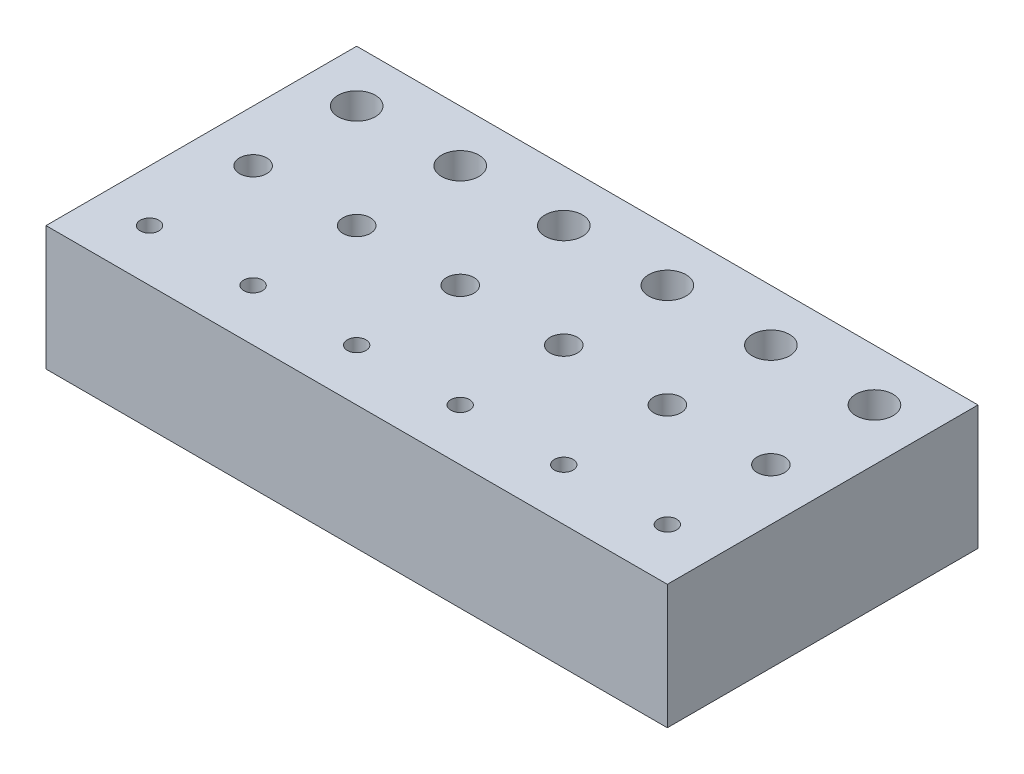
ISO-10303-21;
HEADER;
FILE_DESCRIPTION(('STEP AP214'),'2;1');
FILE_NAME('part.step','',(''),(''),'','','');
FILE_SCHEMA(('AUTOMOTIVE_DESIGN { 1 0 10303 214 1 1 1 1 }'));
ENDSEC;
DATA;
#1=APPLICATION_CONTEXT('core data for automotive mechanical design processes');
#2=APPLICATION_PROTOCOL_DEFINITION('international standard','automotive_design',2000,#1);
#3=PRODUCT_CONTEXT('',#1,'mechanical');
#4=PRODUCT('Part','Part','',(#3));
#5=PRODUCT_RELATED_PRODUCT_CATEGORY('part','',(#4));
#6=PRODUCT_DEFINITION_FORMATION('','',#4);
#7=PRODUCT_DEFINITION_CONTEXT('part definition',#1,'design');
#8=PRODUCT_DEFINITION('design','',#6,#7);
#9=PRODUCT_DEFINITION_SHAPE('','',#8);
#10=(LENGTH_UNIT() NAMED_UNIT(*) SI_UNIT(.MILLI.,.METRE.));
#11=(NAMED_UNIT(*) PLANE_ANGLE_UNIT() SI_UNIT($,.RADIAN.));
#12=(NAMED_UNIT(*) SI_UNIT($,.STERADIAN.) SOLID_ANGLE_UNIT());
#13=UNCERTAINTY_MEASURE_WITH_UNIT(LENGTH_MEASURE(1.E-05),#10,'distance_accuracy_value','');
#14=(GEOMETRIC_REPRESENTATION_CONTEXT(3) GLOBAL_UNCERTAINTY_ASSIGNED_CONTEXT((#13)) GLOBAL_UNIT_ASSIGNED_CONTEXT((#10,
#11,#12)) REPRESENTATION_CONTEXT('',''));
#15=CARTESIAN_POINT('',(0.,0.,0.));
#16=DIRECTION('',(0.,0.,1.));
#17=DIRECTION('',(1.,0.,0.));
#18=AXIS2_PLACEMENT_3D('',#15,#16,#17);
#19=CARTESIAN_POINT('',(62.5,15.,25.));
#20=DIRECTION('',(0.,1.,0.));
#21=DIRECTION('',(0.,0.,1.));
#22=AXIS2_PLACEMENT_3D('',#19,#20,#21);
#23=CYLINDRICAL_SURFACE('',#22,2.25);
#24=CARTESIAN_POINT('',(62.5,-15.,25.));
#25=DIRECTION('',(0.,1.,0.));
#26=DIRECTION('',(0.,0.,1.));
#27=AXIS2_PLACEMENT_3D('',#24,#25,#26);
#28=CIRCLE('',#27,2.25);
#29=CARTESIAN_POINT('',(62.5,-15.,27.25));
#30=VERTEX_POINT('',#29);
#31=EDGE_CURVE('E42',#30,#30,#28,.T.);
#32=ORIENTED_EDGE('',*,*,#31,.F.);
#33=EDGE_LOOP('',(#32));
#34=FACE_BOUND('',#33,.T.);
#35=CARTESIAN_POINT('',(62.5,15.,25.));
#36=DIRECTION('',(0.,1.,0.));
#37=DIRECTION('',(0.,0.,1.));
#38=AXIS2_PLACEMENT_3D('',#35,#36,#37);
#39=CIRCLE('',#38,2.25);
#40=CARTESIAN_POINT('',(62.5,15.,27.25));
#41=VERTEX_POINT('',#40);
#42=EDGE_CURVE('E11',#41,#41,#39,.T.);
#43=ORIENTED_EDGE('',*,*,#42,.T.);
#44=EDGE_LOOP('',(#43));
#45=FACE_BOUND('',#44,.T.);
#46=ADVANCED_FACE('F34',(#34,#45),#23,.F.);
#47=CARTESIAN_POINT('',(37.5,15.,25.));
#48=DIRECTION('',(0.,1.,0.));
#49=DIRECTION('',(0.,0.,1.));
#50=AXIS2_PLACEMENT_3D('',#47,#48,#49);
#51=CYLINDRICAL_SURFACE('',#50,2.25);
#52=CARTESIAN_POINT('',(37.5,-15.,25.));
#53=DIRECTION('',(0.,1.,0.));
#54=DIRECTION('',(0.,0.,1.));
#55=AXIS2_PLACEMENT_3D('',#52,#53,#54);
#56=CIRCLE('',#55,2.25);
#57=CARTESIAN_POINT('',(37.5,-15.,27.25));
#58=VERTEX_POINT('',#57);
#59=EDGE_CURVE('E172',#58,#58,#56,.T.);
#60=ORIENTED_EDGE('',*,*,#59,.F.);
#61=EDGE_LOOP('',(#60));
#62=FACE_BOUND('',#61,.T.);
#63=CARTESIAN_POINT('',(37.5,15.,25.));
#64=DIRECTION('',(0.,1.,0.));
#65=DIRECTION('',(0.,0.,1.));
#66=AXIS2_PLACEMENT_3D('',#63,#64,#65);
#67=CIRCLE('',#66,2.25);
#68=CARTESIAN_POINT('',(37.5,15.,27.25));
#69=VERTEX_POINT('',#68);
#70=EDGE_CURVE('E175',#69,#69,#67,.T.);
#71=ORIENTED_EDGE('',*,*,#70,.T.);
#72=EDGE_LOOP('',(#71));
#73=FACE_BOUND('',#72,.T.);
#74=ADVANCED_FACE('F184',(#62,#73),#51,.F.);
#75=CARTESIAN_POINT('',(12.5,15.,25.));
#76=DIRECTION('',(0.,1.,0.));
#77=DIRECTION('',(0.,0.,1.));
#78=AXIS2_PLACEMENT_3D('',#75,#76,#77);
#79=CYLINDRICAL_SURFACE('',#78,2.25);
#80=CARTESIAN_POINT('',(12.5,-15.,25.));
#81=DIRECTION('',(0.,1.,0.));
#82=DIRECTION('',(0.,0.,1.));
#83=AXIS2_PLACEMENT_3D('',#80,#81,#82);
#84=CIRCLE('',#83,2.25);
#85=CARTESIAN_POINT('',(12.5,-15.,27.25));
#86=VERTEX_POINT('',#85);
#87=EDGE_CURVE('E166',#86,#86,#84,.T.);
#88=ORIENTED_EDGE('',*,*,#87,.F.);
#89=EDGE_LOOP('',(#88));
#90=FACE_BOUND('',#89,.T.);
#91=CARTESIAN_POINT('',(12.5,15.,25.));
#92=DIRECTION('',(0.,1.,0.));
#93=DIRECTION('',(0.,0.,1.));
#94=AXIS2_PLACEMENT_3D('',#91,#92,#93);
#95=CIRCLE('',#94,2.25);
#96=CARTESIAN_POINT('',(12.5,15.,27.25));
#97=VERTEX_POINT('',#96);
#98=EDGE_CURVE('E169',#97,#97,#95,.T.);
#99=ORIENTED_EDGE('',*,*,#98,.T.);
#100=EDGE_LOOP('',(#99));
#101=FACE_BOUND('',#100,.T.);
#102=ADVANCED_FACE('F237',(#90,#101),#79,.F.);
#103=CARTESIAN_POINT('',(-12.5,15.,25.));
#104=DIRECTION('',(0.,1.,0.));
#105=DIRECTION('',(0.,0.,1.));
#106=AXIS2_PLACEMENT_3D('',#103,#104,#105);
#107=CYLINDRICAL_SURFACE('',#106,2.25);
#108=CARTESIAN_POINT('',(-12.5,-15.,25.));
#109=DIRECTION('',(0.,1.,0.));
#110=DIRECTION('',(0.,0.,1.));
#111=AXIS2_PLACEMENT_3D('',#108,#109,#110);
#112=CIRCLE('',#111,2.25);
#113=CARTESIAN_POINT('',(-12.5,-15.,27.25));
#114=VERTEX_POINT('',#113);
#115=EDGE_CURVE('E160',#114,#114,#112,.T.);
#116=ORIENTED_EDGE('',*,*,#115,.F.);
#117=EDGE_LOOP('',(#116));
#118=FACE_BOUND('',#117,.T.);
#119=CARTESIAN_POINT('',(-12.5,15.,25.));
#120=DIRECTION('',(0.,1.,0.));
#121=DIRECTION('',(0.,0.,1.));
#122=AXIS2_PLACEMENT_3D('',#119,#120,#121);
#123=CIRCLE('',#122,2.25);
#124=CARTESIAN_POINT('',(-12.5,15.,27.25));
#125=VERTEX_POINT('',#124);
#126=EDGE_CURVE('E163',#125,#125,#123,.T.);
#127=ORIENTED_EDGE('',*,*,#126,.T.);
#128=EDGE_LOOP('',(#127));
#129=FACE_BOUND('',#128,.T.);
#130=ADVANCED_FACE('F233',(#118,#129),#107,.F.);
#131=CARTESIAN_POINT('',(62.5,15.,0.));
#132=DIRECTION('',(0.,1.,0.));
#133=DIRECTION('',(0.,0.,1.));
#134=AXIS2_PLACEMENT_3D('',#131,#132,#133);
#135=CYLINDRICAL_SURFACE('',#134,3.3);
#136=CARTESIAN_POINT('',(62.5,-15.,0.));
#137=DIRECTION('',(0.,1.,0.));
#138=DIRECTION('',(0.,0.,1.));
#139=AXIS2_PLACEMENT_3D('',#136,#137,#138);
#140=CIRCLE('',#139,3.3);
#141=CARTESIAN_POINT('',(62.5,-15.,3.3));
#142=VERTEX_POINT('',#141);
#143=EDGE_CURVE('E154',#142,#142,#140,.T.);
#144=ORIENTED_EDGE('',*,*,#143,.F.);
#145=EDGE_LOOP('',(#144));
#146=FACE_BOUND('',#145,.T.);
#147=CARTESIAN_POINT('',(62.5,15.,0.));
#148=DIRECTION('',(0.,1.,0.));
#149=DIRECTION('',(0.,0.,1.));
#150=AXIS2_PLACEMENT_3D('',#147,#148,#149);
#151=CIRCLE('',#150,3.3);
#152=CARTESIAN_POINT('',(62.5,15.,3.3));
#153=VERTEX_POINT('',#152);
#154=EDGE_CURVE('E157',#153,#153,#151,.T.);
#155=ORIENTED_EDGE('',*,*,#154,.T.);
#156=EDGE_LOOP('',(#155));
#157=FACE_BOUND('',#156,.T.);
#158=ADVANCED_FACE('F229',(#146,#157),#135,.F.);
#159=CARTESIAN_POINT('',(37.5,15.,0.));
#160=DIRECTION('',(0.,1.,0.));
#161=DIRECTION('',(0.,0.,1.));
#162=AXIS2_PLACEMENT_3D('',#159,#160,#161);
#163=CYLINDRICAL_SURFACE('',#162,3.3);
#164=CARTESIAN_POINT('',(37.5,-15.,0.));
#165=DIRECTION('',(0.,1.,0.));
#166=DIRECTION('',(0.,0.,1.));
#167=AXIS2_PLACEMENT_3D('',#164,#165,#166);
#168=CIRCLE('',#167,3.3);
#169=CARTESIAN_POINT('',(37.5,-15.,3.3));
#170=VERTEX_POINT('',#169);
#171=EDGE_CURVE('E148',#170,#170,#168,.T.);
#172=ORIENTED_EDGE('',*,*,#171,.F.);
#173=EDGE_LOOP('',(#172));
#174=FACE_BOUND('',#173,.T.);
#175=CARTESIAN_POINT('',(37.5,15.,0.));
#176=DIRECTION('',(0.,1.,0.));
#177=DIRECTION('',(0.,0.,1.));
#178=AXIS2_PLACEMENT_3D('',#175,#176,#177);
#179=CIRCLE('',#178,3.3);
#180=CARTESIAN_POINT('',(37.5,15.,3.3));
#181=VERTEX_POINT('',#180);
#182=EDGE_CURVE('E151',#181,#181,#179,.T.);
#183=ORIENTED_EDGE('',*,*,#182,.T.);
#184=EDGE_LOOP('',(#183));
#185=FACE_BOUND('',#184,.T.);
#186=ADVANCED_FACE('F225',(#174,#185),#163,.F.);
#187=CARTESIAN_POINT('',(12.5,15.,0.));
#188=DIRECTION('',(0.,1.,0.));
#189=DIRECTION('',(0.,0.,1.));
#190=AXIS2_PLACEMENT_3D('',#187,#188,#189);
#191=CYLINDRICAL_SURFACE('',#190,3.3);
#192=CARTESIAN_POINT('',(12.5,-15.,0.));
#193=DIRECTION('',(0.,1.,0.));
#194=DIRECTION('',(0.,0.,1.));
#195=AXIS2_PLACEMENT_3D('',#192,#193,#194);
#196=CIRCLE('',#195,3.3);
#197=CARTESIAN_POINT('',(12.5,-15.,3.3));
#198=VERTEX_POINT('',#197);
#199=EDGE_CURVE('E142',#198,#198,#196,.T.);
#200=ORIENTED_EDGE('',*,*,#199,.F.);
#201=EDGE_LOOP('',(#200));
#202=FACE_BOUND('',#201,.T.);
#203=CARTESIAN_POINT('',(12.5,15.,0.));
#204=DIRECTION('',(0.,1.,0.));
#205=DIRECTION('',(0.,0.,1.));
#206=AXIS2_PLACEMENT_3D('',#203,#204,#205);
#207=CIRCLE('',#206,3.3);
#208=CARTESIAN_POINT('',(12.5,15.,3.3));
#209=VERTEX_POINT('',#208);
#210=EDGE_CURVE('E145',#209,#209,#207,.T.);
#211=ORIENTED_EDGE('',*,*,#210,.T.);
#212=EDGE_LOOP('',(#211));
#213=FACE_BOUND('',#212,.T.);
#214=ADVANCED_FACE('F221',(#202,#213),#191,.F.);
#215=CARTESIAN_POINT('',(-12.5,15.,0.));
#216=DIRECTION('',(0.,1.,0.));
#217=DIRECTION('',(0.,0.,1.));
#218=AXIS2_PLACEMENT_3D('',#215,#216,#217);
#219=CYLINDRICAL_SURFACE('',#218,3.3);
#220=CARTESIAN_POINT('',(-12.5,-15.,0.));
#221=DIRECTION('',(0.,1.,0.));
#222=DIRECTION('',(0.,0.,1.));
#223=AXIS2_PLACEMENT_3D('',#220,#221,#222);
#224=CIRCLE('',#223,3.3);
#225=CARTESIAN_POINT('',(-12.5,-15.,3.3));
#226=VERTEX_POINT('',#225);
#227=EDGE_CURVE('E136',#226,#226,#224,.T.);
#228=ORIENTED_EDGE('',*,*,#227,.F.);
#229=EDGE_LOOP('',(#228));
#230=FACE_BOUND('',#229,.T.);
#231=CARTESIAN_POINT('',(-12.5,15.,0.));
#232=DIRECTION('',(0.,1.,0.));
#233=DIRECTION('',(0.,0.,1.));
#234=AXIS2_PLACEMENT_3D('',#231,#232,#233);
#235=CIRCLE('',#234,3.3);
#236=CARTESIAN_POINT('',(-12.5,15.,3.3));
#237=VERTEX_POINT('',#236);
#238=EDGE_CURVE('E139',#237,#237,#235,.T.);
#239=ORIENTED_EDGE('',*,*,#238,.T.);
#240=EDGE_LOOP('',(#239));
#241=FACE_BOUND('',#240,.T.);
#242=ADVANCED_FACE('F217',(#230,#241),#219,.F.);
#243=CARTESIAN_POINT('',(62.5,15.,-25.));
#244=DIRECTION('',(0.,1.,0.));
#245=DIRECTION('',(0.,0.,1.));
#246=AXIS2_PLACEMENT_3D('',#243,#244,#245);
#247=CYLINDRICAL_SURFACE('',#246,4.5);
#248=CARTESIAN_POINT('',(62.5,-15.,-25.));
#249=DIRECTION('',(0.,1.,0.));
#250=DIRECTION('',(0.,0.,1.));
#251=AXIS2_PLACEMENT_3D('',#248,#249,#250);
#252=CIRCLE('',#251,4.5);
#253=CARTESIAN_POINT('',(62.5,-15.,-20.5));
#254=VERTEX_POINT('',#253);
#255=EDGE_CURVE('E130',#254,#254,#252,.T.);
#256=ORIENTED_EDGE('',*,*,#255,.F.);
#257=EDGE_LOOP('',(#256));
#258=FACE_BOUND('',#257,.T.);
#259=CARTESIAN_POINT('',(62.5,15.,-25.));
#260=DIRECTION('',(0.,1.,0.));
#261=DIRECTION('',(0.,0.,1.));
#262=AXIS2_PLACEMENT_3D('',#259,#260,#261);
#263=CIRCLE('',#262,4.5);
#264=CARTESIAN_POINT('',(62.5,15.,-20.5));
#265=VERTEX_POINT('',#264);
#266=EDGE_CURVE('E133',#265,#265,#263,.T.);
#267=ORIENTED_EDGE('',*,*,#266,.T.);
#268=EDGE_LOOP('',(#267));
#269=FACE_BOUND('',#268,.T.);
#270=ADVANCED_FACE('F213',(#258,#269),#247,.F.);
#271=CARTESIAN_POINT('',(37.5,15.,-25.));
#272=DIRECTION('',(0.,1.,0.));
#273=DIRECTION('',(0.,0.,1.));
#274=AXIS2_PLACEMENT_3D('',#271,#272,#273);
#275=CYLINDRICAL_SURFACE('',#274,4.5);
#276=CARTESIAN_POINT('',(37.5,-15.,-25.));
#277=DIRECTION('',(0.,1.,0.));
#278=DIRECTION('',(0.,0.,1.));
#279=AXIS2_PLACEMENT_3D('',#276,#277,#278);
#280=CIRCLE('',#279,4.5);
#281=CARTESIAN_POINT('',(37.5,-15.,-20.5));
#282=VERTEX_POINT('',#281);
#283=EDGE_CURVE('E124',#282,#282,#280,.T.);
#284=ORIENTED_EDGE('',*,*,#283,.F.);
#285=EDGE_LOOP('',(#284));
#286=FACE_BOUND('',#285,.T.);
#287=CARTESIAN_POINT('',(37.5,15.,-25.));
#288=DIRECTION('',(0.,1.,0.));
#289=DIRECTION('',(0.,0.,1.));
#290=AXIS2_PLACEMENT_3D('',#287,#288,#289);
#291=CIRCLE('',#290,4.5);
#292=CARTESIAN_POINT('',(37.5,15.,-20.5));
#293=VERTEX_POINT('',#292);
#294=EDGE_CURVE('E127',#293,#293,#291,.T.);
#295=ORIENTED_EDGE('',*,*,#294,.T.);
#296=EDGE_LOOP('',(#295));
#297=FACE_BOUND('',#296,.T.);
#298=ADVANCED_FACE('F209',(#286,#297),#275,.F.);
#299=CARTESIAN_POINT('',(12.5,15.,-25.));
#300=DIRECTION('',(0.,1.,0.));
#301=DIRECTION('',(0.,0.,1.));
#302=AXIS2_PLACEMENT_3D('',#299,#300,#301);
#303=CYLINDRICAL_SURFACE('',#302,4.5);
#304=CARTESIAN_POINT('',(12.5,-15.,-25.));
#305=DIRECTION('',(0.,1.,0.));
#306=DIRECTION('',(0.,0.,1.));
#307=AXIS2_PLACEMENT_3D('',#304,#305,#306);
#308=CIRCLE('',#307,4.5);
#309=CARTESIAN_POINT('',(12.5,-15.,-20.5));
#310=VERTEX_POINT('',#309);
#311=EDGE_CURVE('E118',#310,#310,#308,.T.);
#312=ORIENTED_EDGE('',*,*,#311,.F.);
#313=EDGE_LOOP('',(#312));
#314=FACE_BOUND('',#313,.T.);
#315=CARTESIAN_POINT('',(12.5,15.,-25.));
#316=DIRECTION('',(0.,1.,0.));
#317=DIRECTION('',(0.,0.,1.));
#318=AXIS2_PLACEMENT_3D('',#315,#316,#317);
#319=CIRCLE('',#318,4.5);
#320=CARTESIAN_POINT('',(12.5,15.,-20.5));
#321=VERTEX_POINT('',#320);
#322=EDGE_CURVE('E121',#321,#321,#319,.T.);
#323=ORIENTED_EDGE('',*,*,#322,.T.);
#324=EDGE_LOOP('',(#323));
#325=FACE_BOUND('',#324,.T.);
#326=ADVANCED_FACE('F205',(#314,#325),#303,.F.);
#327=CARTESIAN_POINT('',(-12.5,15.,-25.));
#328=DIRECTION('',(0.,1.,0.));
#329=DIRECTION('',(0.,0.,1.));
#330=AXIS2_PLACEMENT_3D('',#327,#328,#329);
#331=CYLINDRICAL_SURFACE('',#330,4.5);
#332=CARTESIAN_POINT('',(-12.5,-15.,-25.));
#333=DIRECTION('',(0.,1.,0.));
#334=DIRECTION('',(0.,0.,1.));
#335=AXIS2_PLACEMENT_3D('',#332,#333,#334);
#336=CIRCLE('',#335,4.5);
#337=CARTESIAN_POINT('',(-12.5,-15.,-20.5));
#338=VERTEX_POINT('',#337);
#339=EDGE_CURVE('E112',#338,#338,#336,.T.);
#340=ORIENTED_EDGE('',*,*,#339,.F.);
#341=EDGE_LOOP('',(#340));
#342=FACE_BOUND('',#341,.T.);
#343=CARTESIAN_POINT('',(-12.5,15.,-25.));
#344=DIRECTION('',(0.,1.,0.));
#345=DIRECTION('',(0.,0.,1.));
#346=AXIS2_PLACEMENT_3D('',#343,#344,#345);
#347=CIRCLE('',#346,4.5);
#348=CARTESIAN_POINT('',(-12.5,15.,-20.5));
#349=VERTEX_POINT('',#348);
#350=EDGE_CURVE('E115',#349,#349,#347,.T.);
#351=ORIENTED_EDGE('',*,*,#350,.T.);
#352=EDGE_LOOP('',(#351));
#353=FACE_BOUND('',#352,.T.);
#354=ADVANCED_FACE('F196',(#342,#353),#331,.F.);
#355=CARTESIAN_POINT('',(75.,15.,37.5));
#356=DIRECTION('',(-1.,0.,0.));
#357=DIRECTION('',(0.,0.,1.));
#358=AXIS2_PLACEMENT_3D('',#355,#356,#357);
#359=PLANE('',#358);
#360=DIRECTION('',(0.,1.,0.));
#361=VECTOR('',#360,1.);
#362=CARTESIAN_POINT('',(75.,15.,-37.5));
#363=LINE('',#362,#361);
#364=CARTESIAN_POINT('',(75.,-15.,-37.5));
#365=VERTEX_POINT('',#364);
#366=CARTESIAN_POINT('',(75.,15.,-37.5));
#367=VERTEX_POINT('',#366);
#368=EDGE_CURVE('E102',#365,#367,#363,.T.);
#369=ORIENTED_EDGE('',*,*,#368,.T.);
#370=DIRECTION('',(0.,0.,-1.));
#371=VECTOR('',#370,1.);
#372=CARTESIAN_POINT('',(75.,15.,37.5));
#373=LINE('',#372,#371);
#374=CARTESIAN_POINT('',(75.,15.,37.5));
#375=VERTEX_POINT('',#374);
#376=EDGE_CURVE('E93',#375,#367,#373,.T.);
#377=ORIENTED_EDGE('',*,*,#376,.F.);
#378=DIRECTION('',(0.,1.,0.));
#379=VECTOR('',#378,1.);
#380=CARTESIAN_POINT('',(75.,15.,37.5));
#381=LINE('',#380,#379);
#382=CARTESIAN_POINT('',(75.,-15.,37.5));
#383=VERTEX_POINT('',#382);
#384=EDGE_CURVE('E86',#383,#375,#381,.T.);
#385=ORIENTED_EDGE('',*,*,#384,.F.);
#386=DIRECTION('',(0.,0.,-1.));
#387=VECTOR('',#386,1.);
#388=CARTESIAN_POINT('',(75.,-15.,37.5));
#389=LINE('',#388,#387);
#390=EDGE_CURVE('E98',#383,#365,#389,.T.);
#391=ORIENTED_EDGE('',*,*,#390,.T.);
#392=EDGE_LOOP('',(#369,#377,#385,#391));
#393=FACE_BOUND('',#392,.T.);
#394=ADVANCED_FACE('F188',(#393),#359,.F.);
#395=CARTESIAN_POINT('',(-75.,15.,37.5));
#396=DIRECTION('',(0.,-1.,0.));
#397=DIRECTION('',(0.,0.,-1.));
#398=AXIS2_PLACEMENT_3D('',#395,#396,#397);
#399=PLANE('',#398);
#400=CARTESIAN_POINT('',(-37.5,15.,25.));
#401=DIRECTION('',(0.,1.,0.));
#402=DIRECTION('',(0.,0.,1.));
#403=AXIS2_PLACEMENT_3D('',#400,#401,#402);
#404=CIRCLE('',#403,2.25);
#405=CARTESIAN_POINT('',(-37.5,15.,27.25));
#406=VERTEX_POINT('',#405);
#407=EDGE_CURVE('E292',#406,#406,#404,.T.);
#408=ORIENTED_EDGE('',*,*,#407,.F.);
#409=EDGE_LOOP('',(#408));
#410=FACE_BOUND('',#409,.T.);
#411=CARTESIAN_POINT('',(-62.5,15.,25.));
#412=DIRECTION('',(0.,1.,0.));
#413=DIRECTION('',(0.,0.,1.));
#414=AXIS2_PLACEMENT_3D('',#411,#412,#413);
#415=CIRCLE('',#414,2.25);
#416=CARTESIAN_POINT('',(-62.5,15.,27.25));
#417=VERTEX_POINT('',#416);
#418=EDGE_CURVE('E293',#417,#417,#415,.T.);
#419=ORIENTED_EDGE('',*,*,#418,.F.);
#420=EDGE_LOOP('',(#419));
#421=FACE_BOUND('',#420,.T.);
#422=CARTESIAN_POINT('',(-37.5,15.,0.));
#423=DIRECTION('',(0.,1.,0.));
#424=DIRECTION('',(0.,0.,1.));
#425=AXIS2_PLACEMENT_3D('',#422,#423,#424);
#426=CIRCLE('',#425,3.3);
#427=CARTESIAN_POINT('',(-37.5,15.,3.3));
#428=VERTEX_POINT('',#427);
#429=EDGE_CURVE('E305',#428,#428,#426,.T.);
#430=ORIENTED_EDGE('',*,*,#429,.F.);
#431=EDGE_LOOP('',(#430));
#432=FACE_BOUND('',#431,.T.);
#433=CARTESIAN_POINT('',(-62.5,15.,0.));
#434=DIRECTION('',(0.,1.,0.));
#435=DIRECTION('',(0.,0.,1.));
#436=AXIS2_PLACEMENT_3D('',#433,#434,#435);
#437=CIRCLE('',#436,3.3);
#438=CARTESIAN_POINT('',(-62.5,15.,3.3));
#439=VERTEX_POINT('',#438);
#440=EDGE_CURVE('E308',#439,#439,#437,.T.);
#441=ORIENTED_EDGE('',*,*,#440,.F.);
#442=EDGE_LOOP('',(#441));
#443=FACE_BOUND('',#442,.T.);
#444=CARTESIAN_POINT('',(-37.5,15.,-25.));
#445=DIRECTION('',(0.,1.,0.));
#446=DIRECTION('',(0.,0.,1.));
#447=AXIS2_PLACEMENT_3D('',#444,#445,#446);
#448=CIRCLE('',#447,4.5);
#449=CARTESIAN_POINT('',(-37.5,15.,-20.5));
#450=VERTEX_POINT('',#449);
#451=EDGE_CURVE('E317',#450,#450,#448,.T.);
#452=ORIENTED_EDGE('',*,*,#451,.F.);
#453=EDGE_LOOP('',(#452));
#454=FACE_BOUND('',#453,.T.);
#455=CARTESIAN_POINT('',(-62.5,15.,-25.));
#456=DIRECTION('',(0.,1.,0.));
#457=DIRECTION('',(0.,0.,1.));
#458=AXIS2_PLACEMENT_3D('',#455,#456,#457);
#459=CIRCLE('',#458,4.5);
#460=CARTESIAN_POINT('',(-62.5,15.,-20.5));
#461=VERTEX_POINT('',#460);
#462=EDGE_CURVE('E320',#461,#461,#459,.T.);
#463=ORIENTED_EDGE('',*,*,#462,.F.);
#464=EDGE_LOOP('',(#463));
#465=FACE_BOUND('',#464,.T.);
#466=DIRECTION('',(-1.,0.,0.));
#467=VECTOR('',#466,1.);
#468=CARTESIAN_POINT('',(-75.,15.,-37.5));
#469=LINE('',#468,#467);
#470=CARTESIAN_POINT('',(-75.,15.,-37.5));
#471=VERTEX_POINT('',#470);
#472=EDGE_CURVE('E92',#367,#471,#469,.T.);
#473=ORIENTED_EDGE('',*,*,#472,.T.);
#474=DIRECTION('',(0.,0.,-1.));
#475=VECTOR('',#474,1.);
#476=CARTESIAN_POINT('',(-75.,15.,37.5));
#477=LINE('',#476,#475);
#478=CARTESIAN_POINT('',(-75.,15.,37.5));
#479=VERTEX_POINT('',#478);
#480=EDGE_CURVE('E89',#479,#471,#477,.T.);
#481=ORIENTED_EDGE('',*,*,#480,.F.);
#482=DIRECTION('',(-1.,0.,0.));
#483=VECTOR('',#482,1.);
#484=CARTESIAN_POINT('',(-75.,15.,37.5));
#485=LINE('',#484,#483);
#486=EDGE_CURVE('E81',#375,#479,#485,.T.);
#487=ORIENTED_EDGE('',*,*,#486,.F.);
#488=ORIENTED_EDGE('',*,*,#376,.T.);
#489=EDGE_LOOP('',(#473,#481,#487,#488));
#490=FACE_BOUND('',#489,.T.);
#491=ORIENTED_EDGE('',*,*,#350,.F.);
#492=EDGE_LOOP('',(#491));
#493=FACE_BOUND('',#492,.T.);
#494=ORIENTED_EDGE('',*,*,#322,.F.);
#495=EDGE_LOOP('',(#494));
#496=FACE_BOUND('',#495,.T.);
#497=ORIENTED_EDGE('',*,*,#294,.F.);
#498=EDGE_LOOP('',(#497));
#499=FACE_BOUND('',#498,.T.);
#500=ORIENTED_EDGE('',*,*,#266,.F.);
#501=EDGE_LOOP('',(#500));
#502=FACE_BOUND('',#501,.T.);
#503=ORIENTED_EDGE('',*,*,#238,.F.);
#504=EDGE_LOOP('',(#503));
#505=FACE_BOUND('',#504,.T.);
#506=ORIENTED_EDGE('',*,*,#210,.F.);
#507=EDGE_LOOP('',(#506));
#508=FACE_BOUND('',#507,.T.);
#509=ORIENTED_EDGE('',*,*,#182,.F.);
#510=EDGE_LOOP('',(#509));
#511=FACE_BOUND('',#510,.T.);
#512=ORIENTED_EDGE('',*,*,#154,.F.);
#513=EDGE_LOOP('',(#512));
#514=FACE_BOUND('',#513,.T.);
#515=ORIENTED_EDGE('',*,*,#126,.F.);
#516=EDGE_LOOP('',(#515));
#517=FACE_BOUND('',#516,.T.);
#518=ORIENTED_EDGE('',*,*,#98,.F.);
#519=EDGE_LOOP('',(#518));
#520=FACE_BOUND('',#519,.T.);
#521=ORIENTED_EDGE('',*,*,#70,.F.);
#522=EDGE_LOOP('',(#521));
#523=FACE_BOUND('',#522,.T.);
#524=ORIENTED_EDGE('',*,*,#42,.F.);
#525=EDGE_LOOP('',(#524));
#526=FACE_BOUND('',#525,.T.);
#527=ADVANCED_FACE('F90',(#410,#421,#432,#443,#454,#465,#490,#493,#496,#499,#502,#505,#508,#511,
#514,#517,#520,#523,#526),#399,.F.);
#528=CARTESIAN_POINT('',(-75.,15.,37.5));
#529=DIRECTION('',(1.,0.,0.));
#530=DIRECTION('',(0.,0.,-1.));
#531=AXIS2_PLACEMENT_3D('',#528,#529,#530);
#532=PLANE('',#531);
#533=DIRECTION('',(0.,-1.,0.));
#534=VECTOR('',#533,1.);
#535=CARTESIAN_POINT('',(-75.,15.,-37.5));
#536=LINE('',#535,#534);
#537=CARTESIAN_POINT('',(-75.,-15.,-37.5));
#538=VERTEX_POINT('',#537);
#539=EDGE_CURVE('E67',#471,#538,#536,.T.);
#540=ORIENTED_EDGE('',*,*,#539,.T.);
#541=DIRECTION('',(0.,0.,-1.));
#542=VECTOR('',#541,1.);
#543=CARTESIAN_POINT('',(-75.,-15.,37.5));
#544=LINE('',#543,#542);
#545=CARTESIAN_POINT('',(-75.,-15.,37.5));
#546=VERTEX_POINT('',#545);
#547=EDGE_CURVE('E94',#546,#538,#544,.T.);
#548=ORIENTED_EDGE('',*,*,#547,.F.);
#549=DIRECTION('',(0.,-1.,0.));
#550=VECTOR('',#549,1.);
#551=CARTESIAN_POINT('',(-75.,15.,37.5));
#552=LINE('',#551,#550);
#553=EDGE_CURVE('E84',#479,#546,#552,.T.);
#554=ORIENTED_EDGE('',*,*,#553,.F.);
#555=ORIENTED_EDGE('',*,*,#480,.T.);
#556=EDGE_LOOP('',(#540,#548,#554,#555));
#557=FACE_BOUND('',#556,.T.);
#558=ADVANCED_FACE('F96',(#557),#532,.F.);
#559=CARTESIAN_POINT('',(-75.,-15.,37.5));
#560=DIRECTION('',(0.,1.,0.));
#561=DIRECTION('',(0.,0.,1.));
#562=AXIS2_PLACEMENT_3D('',#559,#560,#561);
#563=PLANE('',#562);
#564=CARTESIAN_POINT('',(-37.5,-15.,25.));
#565=DIRECTION('',(0.,1.,0.));
#566=DIRECTION('',(0.,0.,1.));
#567=AXIS2_PLACEMENT_3D('',#564,#565,#566);
#568=CIRCLE('',#567,2.25);
#569=CARTESIAN_POINT('',(-37.5,-15.,27.25));
#570=VERTEX_POINT('',#569);
#571=EDGE_CURVE('E290',#570,#570,#568,.T.);
#572=ORIENTED_EDGE('',*,*,#571,.T.);
#573=EDGE_LOOP('',(#572));
#574=FACE_BOUND('',#573,.T.);
#575=CARTESIAN_POINT('',(-62.5,-15.,25.));
#576=DIRECTION('',(0.,1.,0.));
#577=DIRECTION('',(0.,0.,1.));
#578=AXIS2_PLACEMENT_3D('',#575,#576,#577);
#579=CIRCLE('',#578,2.25);
#580=CARTESIAN_POINT('',(-62.5,-15.,27.25));
#581=VERTEX_POINT('',#580);
#582=EDGE_CURVE('E296',#581,#581,#579,.T.);
#583=ORIENTED_EDGE('',*,*,#582,.T.);
#584=EDGE_LOOP('',(#583));
#585=FACE_BOUND('',#584,.T.);
#586=CARTESIAN_POINT('',(-37.5,-15.,0.));
#587=DIRECTION('',(0.,1.,0.));
#588=DIRECTION('',(0.,0.,1.));
#589=AXIS2_PLACEMENT_3D('',#586,#587,#588);
#590=CIRCLE('',#589,3.3);
#591=CARTESIAN_POINT('',(-37.5,-15.,3.3));
#592=VERTEX_POINT('',#591);
#593=EDGE_CURVE('E302',#592,#592,#590,.T.);
#594=ORIENTED_EDGE('',*,*,#593,.T.);
#595=EDGE_LOOP('',(#594));
#596=FACE_BOUND('',#595,.T.);
#597=CARTESIAN_POINT('',(-62.5,-15.,0.));
#598=DIRECTION('',(0.,1.,0.));
#599=DIRECTION('',(0.,0.,1.));
#600=AXIS2_PLACEMENT_3D('',#597,#598,#599);
#601=CIRCLE('',#600,3.3);
#602=CARTESIAN_POINT('',(-62.5,-15.,3.3));
#603=VERTEX_POINT('',#602);
#604=EDGE_CURVE('E311',#603,#603,#601,.T.);
#605=ORIENTED_EDGE('',*,*,#604,.T.);
#606=EDGE_LOOP('',(#605));
#607=FACE_BOUND('',#606,.T.);
#608=CARTESIAN_POINT('',(-37.5,-15.,-25.));
#609=DIRECTION('',(0.,1.,0.));
#610=DIRECTION('',(0.,0.,1.));
#611=AXIS2_PLACEMENT_3D('',#608,#609,#610);
#612=CIRCLE('',#611,4.5);
#613=CARTESIAN_POINT('',(-37.5,-15.,-20.5));
#614=VERTEX_POINT('',#613);
#615=EDGE_CURVE('E314',#614,#614,#612,.T.);
#616=ORIENTED_EDGE('',*,*,#615,.T.);
#617=EDGE_LOOP('',(#616));
#618=FACE_BOUND('',#617,.T.);
#619=CARTESIAN_POINT('',(-62.5,-15.,-25.));
#620=DIRECTION('',(0.,1.,0.));
#621=DIRECTION('',(0.,0.,1.));
#622=AXIS2_PLACEMENT_3D('',#619,#620,#621);
#623=CIRCLE('',#622,4.5);
#624=CARTESIAN_POINT('',(-62.5,-15.,-20.5));
#625=VERTEX_POINT('',#624);
#626=EDGE_CURVE('E105',#625,#625,#623,.T.);
#627=ORIENTED_EDGE('',*,*,#626,.T.);
#628=EDGE_LOOP('',(#627));
#629=FACE_BOUND('',#628,.T.);
#630=DIRECTION('',(1.,0.,0.));
#631=VECTOR('',#630,1.);
#632=CARTESIAN_POINT('',(-75.,-15.,-37.5));
#633=LINE('',#632,#631);
#634=EDGE_CURVE('E73',#538,#365,#633,.T.);
#635=ORIENTED_EDGE('',*,*,#634,.T.);
#636=ORIENTED_EDGE('',*,*,#390,.F.);
#637=DIRECTION('',(1.,0.,0.));
#638=VECTOR('',#637,1.);
#639=CARTESIAN_POINT('',(-75.,-15.,37.5));
#640=LINE('',#639,#638);
#641=EDGE_CURVE('E50',#546,#383,#640,.T.);
#642=ORIENTED_EDGE('',*,*,#641,.F.);
#643=ORIENTED_EDGE('',*,*,#547,.T.);
#644=EDGE_LOOP('',(#635,#636,#642,#643));
#645=FACE_BOUND('',#644,.T.);
#646=ORIENTED_EDGE('',*,*,#339,.T.);
#647=EDGE_LOOP('',(#646));
#648=FACE_BOUND('',#647,.T.);
#649=ORIENTED_EDGE('',*,*,#311,.T.);
#650=EDGE_LOOP('',(#649));
#651=FACE_BOUND('',#650,.T.);
#652=ORIENTED_EDGE('',*,*,#283,.T.);
#653=EDGE_LOOP('',(#652));
#654=FACE_BOUND('',#653,.T.);
#655=ORIENTED_EDGE('',*,*,#255,.T.);
#656=EDGE_LOOP('',(#655));
#657=FACE_BOUND('',#656,.T.);
#658=ORIENTED_EDGE('',*,*,#227,.T.);
#659=EDGE_LOOP('',(#658));
#660=FACE_BOUND('',#659,.T.);
#661=ORIENTED_EDGE('',*,*,#199,.T.);
#662=EDGE_LOOP('',(#661));
#663=FACE_BOUND('',#662,.T.);
#664=ORIENTED_EDGE('',*,*,#171,.T.);
#665=EDGE_LOOP('',(#664));
#666=FACE_BOUND('',#665,.T.);
#667=ORIENTED_EDGE('',*,*,#143,.T.);
#668=EDGE_LOOP('',(#667));
#669=FACE_BOUND('',#668,.T.);
#670=ORIENTED_EDGE('',*,*,#115,.T.);
#671=EDGE_LOOP('',(#670));
#672=FACE_BOUND('',#671,.T.);
#673=ORIENTED_EDGE('',*,*,#87,.T.);
#674=EDGE_LOOP('',(#673));
#675=FACE_BOUND('',#674,.T.);
#676=ORIENTED_EDGE('',*,*,#59,.T.);
#677=EDGE_LOOP('',(#676));
#678=FACE_BOUND('',#677,.T.);
#679=ORIENTED_EDGE('',*,*,#31,.T.);
#680=EDGE_LOOP('',(#679));
#681=FACE_BOUND('',#680,.T.);
#682=ADVANCED_FACE('F180',(#574,#585,#596,#607,#618,#629,#645,#648,#651,#654,#657,#660,#663,
#666,#669,#672,#675,#678,#681),#563,.F.);
#683=CARTESIAN_POINT('',(0.,0.,37.5));
#684=DIRECTION('',(0.,0.,1.));
#685=DIRECTION('',(1.,0.,0.));
#686=AXIS2_PLACEMENT_3D('',#683,#684,#685);
#687=PLANE('',#686);
#688=ORIENTED_EDGE('',*,*,#384,.T.);
#689=ORIENTED_EDGE('',*,*,#486,.T.);
#690=ORIENTED_EDGE('',*,*,#553,.T.);
#691=ORIENTED_EDGE('',*,*,#641,.T.);
#692=EDGE_LOOP('',(#688,#689,#690,#691));
#693=FACE_BOUND('',#692,.T.);
#694=ADVANCED_FACE('F82',(#693),#687,.T.);
#695=CARTESIAN_POINT('',(0.,0.,-37.5));
#696=DIRECTION('',(0.,0.,1.));
#697=DIRECTION('',(1.,0.,0.));
#698=AXIS2_PLACEMENT_3D('',#695,#696,#697);
#699=PLANE('',#698);
#700=ORIENTED_EDGE('',*,*,#368,.F.);
#701=ORIENTED_EDGE('',*,*,#634,.F.);
#702=ORIENTED_EDGE('',*,*,#539,.F.);
#703=ORIENTED_EDGE('',*,*,#472,.F.);
#704=EDGE_LOOP('',(#700,#701,#702,#703));
#705=FACE_BOUND('',#704,.T.);
#706=ADVANCED_FACE('F255',(#705),#699,.F.);
#707=CARTESIAN_POINT('',(-62.5,15.,-25.));
#708=DIRECTION('',(0.,1.,0.));
#709=DIRECTION('',(0.,0.,1.));
#710=AXIS2_PLACEMENT_3D('',#707,#708,#709);
#711=CYLINDRICAL_SURFACE('',#710,4.5);
#712=ORIENTED_EDGE('',*,*,#626,.F.);
#713=EDGE_LOOP('',(#712));
#714=FACE_BOUND('',#713,.T.);
#715=ORIENTED_EDGE('',*,*,#462,.T.);
#716=EDGE_LOOP('',(#715));
#717=FACE_BOUND('',#716,.T.);
#718=ADVANCED_FACE('F261',(#714,#717),#711,.F.);
#719=CARTESIAN_POINT('',(-37.5,15.,-25.));
#720=DIRECTION('',(0.,1.,0.));
#721=DIRECTION('',(0.,0.,1.));
#722=AXIS2_PLACEMENT_3D('',#719,#720,#721);
#723=CYLINDRICAL_SURFACE('',#722,4.5);
#724=ORIENTED_EDGE('',*,*,#615,.F.);
#725=EDGE_LOOP('',(#724));
#726=FACE_BOUND('',#725,.T.);
#727=ORIENTED_EDGE('',*,*,#451,.T.);
#728=EDGE_LOOP('',(#727));
#729=FACE_BOUND('',#728,.T.);
#730=ADVANCED_FACE('F266',(#726,#729),#723,.F.);
#731=CARTESIAN_POINT('',(-62.5,15.,0.));
#732=DIRECTION('',(0.,1.,0.));
#733=DIRECTION('',(0.,0.,1.));
#734=AXIS2_PLACEMENT_3D('',#731,#732,#733);
#735=CYLINDRICAL_SURFACE('',#734,3.3);
#736=ORIENTED_EDGE('',*,*,#604,.F.);
#737=EDGE_LOOP('',(#736));
#738=FACE_BOUND('',#737,.T.);
#739=ORIENTED_EDGE('',*,*,#440,.T.);
#740=EDGE_LOOP('',(#739));
#741=FACE_BOUND('',#740,.T.);
#742=ADVANCED_FACE('F270',(#738,#741),#735,.F.);
#743=CARTESIAN_POINT('',(-37.5,15.,0.));
#744=DIRECTION('',(0.,1.,0.));
#745=DIRECTION('',(0.,0.,1.));
#746=AXIS2_PLACEMENT_3D('',#743,#744,#745);
#747=CYLINDRICAL_SURFACE('',#746,3.3);
#748=ORIENTED_EDGE('',*,*,#593,.F.);
#749=EDGE_LOOP('',(#748));
#750=FACE_BOUND('',#749,.T.);
#751=ORIENTED_EDGE('',*,*,#429,.T.);
#752=EDGE_LOOP('',(#751));
#753=FACE_BOUND('',#752,.T.);
#754=ADVANCED_FACE('F274',(#750,#753),#747,.F.);
#755=CARTESIAN_POINT('',(-62.5,15.,25.));
#756=DIRECTION('',(0.,1.,0.));
#757=DIRECTION('',(0.,0.,1.));
#758=AXIS2_PLACEMENT_3D('',#755,#756,#757);
#759=CYLINDRICAL_SURFACE('',#758,2.25);
#760=ORIENTED_EDGE('',*,*,#582,.F.);
#761=EDGE_LOOP('',(#760));
#762=FACE_BOUND('',#761,.T.);
#763=ORIENTED_EDGE('',*,*,#418,.T.);
#764=EDGE_LOOP('',(#763));
#765=FACE_BOUND('',#764,.T.);
#766=ADVANCED_FACE('F278',(#762,#765),#759,.F.);
#767=CARTESIAN_POINT('',(-37.5,15.,25.));
#768=DIRECTION('',(0.,1.,0.));
#769=DIRECTION('',(0.,0.,1.));
#770=AXIS2_PLACEMENT_3D('',#767,#768,#769);
#771=CYLINDRICAL_SURFACE('',#770,2.25);
#772=ORIENTED_EDGE('',*,*,#571,.F.);
#773=EDGE_LOOP('',(#772));
#774=FACE_BOUND('',#773,.T.);
#775=ORIENTED_EDGE('',*,*,#407,.T.);
#776=EDGE_LOOP('',(#775));
#777=FACE_BOUND('',#776,.T.);
#778=ADVANCED_FACE('F282',(#774,#777),#771,.F.);
#779=CLOSED_SHELL('',(#46,#74,#102,#130,#158,#186,#214,#242,#270,#298,#326,#354,#394,#527,#558,
#682,#694,#706,#718,#730,#742,#754,#766,#778));
#780=MANIFOLD_SOLID_BREP('B2',#779);
#781=ADVANCED_BREP_SHAPE_REPRESENTATION('',(#18,#780),#14);
#782=SHAPE_DEFINITION_REPRESENTATION(#9,#781);
ENDSEC;
END-ISO-10303-21;
